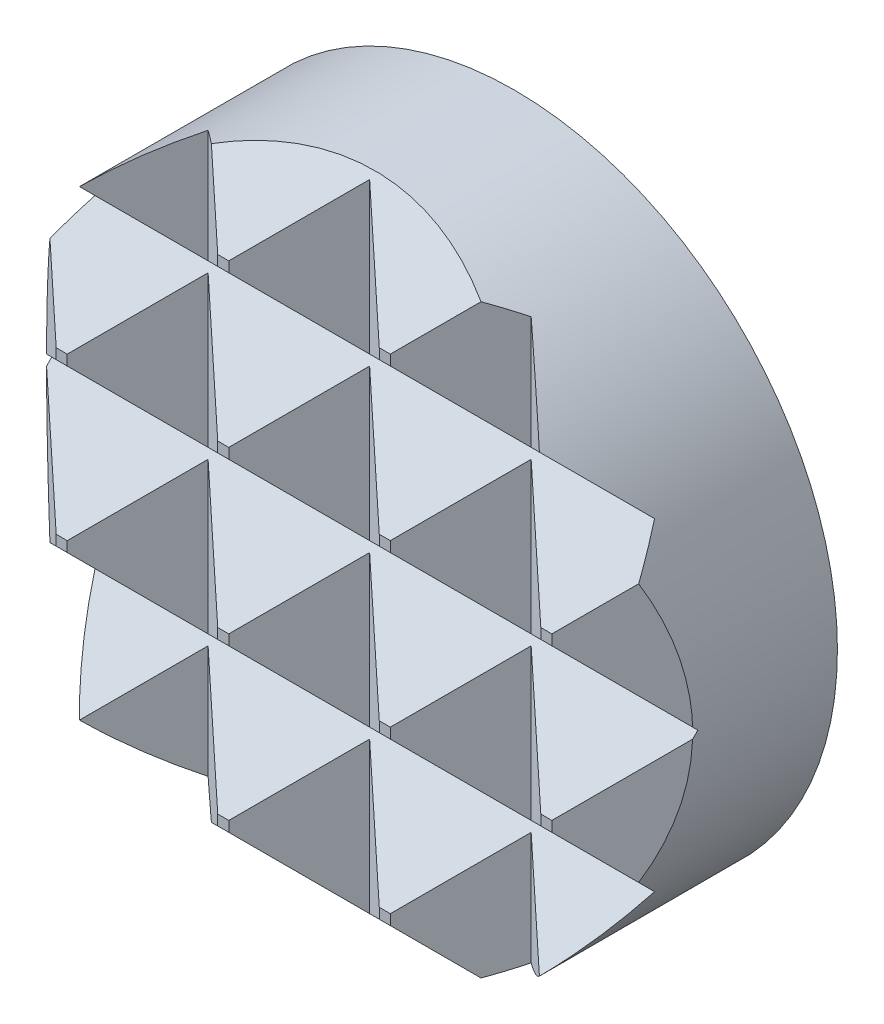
ISO-10303-21;
HEADER;
FILE_DESCRIPTION(('STEP AP214'),'2;1');
FILE_NAME('part.step','',(''),(''),'','','');
FILE_SCHEMA(('AUTOMOTIVE_DESIGN { 1 0 10303 214 1 1 1 1 }'));
ENDSEC;
DATA;
#1=APPLICATION_CONTEXT('core data for automotive mechanical design processes');
#2=APPLICATION_PROTOCOL_DEFINITION('international standard','automotive_design',2000,#1);
#3=PRODUCT_CONTEXT('',#1,'mechanical');
#4=PRODUCT('Part','Part','',(#3));
#5=PRODUCT_RELATED_PRODUCT_CATEGORY('part','',(#4));
#6=PRODUCT_DEFINITION_FORMATION('','',#4);
#7=PRODUCT_DEFINITION_CONTEXT('part definition',#1,'design');
#8=PRODUCT_DEFINITION('design','',#6,#7);
#9=PRODUCT_DEFINITION_SHAPE('','',#8);
#10=(LENGTH_UNIT() NAMED_UNIT(*) SI_UNIT(.MILLI.,.METRE.));
#11=(NAMED_UNIT(*) PLANE_ANGLE_UNIT() SI_UNIT($,.RADIAN.));
#12=(NAMED_UNIT(*) SI_UNIT($,.STERADIAN.) SOLID_ANGLE_UNIT());
#13=UNCERTAINTY_MEASURE_WITH_UNIT(LENGTH_MEASURE(1.E-05),#10,'distance_accuracy_value','');
#14=(GEOMETRIC_REPRESENTATION_CONTEXT(3) GLOBAL_UNCERTAINTY_ASSIGNED_CONTEXT((#13)) GLOBAL_UNIT_ASSIGNED_CONTEXT((#10,
#11,#12)) REPRESENTATION_CONTEXT('',''));
#15=CARTESIAN_POINT('',(0.,0.,0.));
#16=DIRECTION('',(0.,0.,1.));
#17=DIRECTION('',(1.,0.,0.));
#18=AXIS2_PLACEMENT_3D('',#15,#16,#17);
#19=CARTESIAN_POINT('',(4.763525,1.266825,3.679825));
#20=DIRECTION('',(0.,0.,-1.));
#21=DIRECTION('',(-1.,0.,0.));
#22=AXIS2_PLACEMENT_3D('',#19,#20,#21);
#23=PLANE('',#22);
#24=DIRECTION('',(-1.,0.,0.));
#25=VECTOR('',#24,1.);
#26=CARTESIAN_POINT('',(4.763525,1.114425,3.679825));
#27=LINE('',#26,#25);
#28=CARTESIAN_POINT('',(3.724275,1.114425,3.679825));
#29=VERTEX_POINT('',#28);
#30=CARTESIAN_POINT('',(3.56145448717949,1.114425,3.679825));
#31=VERTEX_POINT('',#30);
#32=EDGE_CURVE('E354',#29,#31,#27,.T.);
#33=ORIENTED_EDGE('',*,*,#32,.F.);
#34=DIRECTION('',(0.,1.,0.));
#35=VECTOR('',#34,1.);
#36=CARTESIAN_POINT('',(3.724275,1.266825,3.679825));
#37=LINE('',#36,#35);
#38=CARTESIAN_POINT('',(3.724275,1.266825,3.679825));
#39=VERTEX_POINT('',#38);
#40=EDGE_CURVE('E29',#29,#39,#37,.T.);
#41=ORIENTED_EDGE('',*,*,#40,.T.);
#42=DIRECTION('',(-1.,0.,0.));
#43=VECTOR('',#42,1.);
#44=CARTESIAN_POINT('',(4.763525,1.266825,3.679825));
#45=LINE('',#44,#43);
#46=CARTESIAN_POINT('',(3.56145448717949,1.266825,3.679825));
#47=VERTEX_POINT('',#46);
#48=EDGE_CURVE('E349',#39,#47,#45,.T.);
#49=ORIENTED_EDGE('',*,*,#48,.T.);
#50=DIRECTION('',(0.,-1.,0.));
#51=VECTOR('',#50,1.);
#52=CARTESIAN_POINT('',(3.56145448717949,1.266825,3.679825));
#53=LINE('',#52,#51);
#54=EDGE_CURVE('E480',#47,#31,#53,.T.);
#55=ORIENTED_EDGE('',*,*,#54,.T.);
#56=EDGE_LOOP('',(#33,#41,#49,#55));
#57=FACE_BOUND('',#56,.T.);
#58=ADVANCED_FACE('F14',(#57),#23,.F.);
#59=CARTESIAN_POINT('',(4.763525,-1.114425,3.679825));
#60=DIRECTION('',(0.,0.,-1.));
#61=DIRECTION('',(-1.,0.,0.));
#62=AXIS2_PLACEMENT_3D('',#59,#60,#61);
#63=PLANE('',#62);
#64=DIRECTION('',(-1.,0.,0.));
#65=VECTOR('',#64,1.);
#66=CARTESIAN_POINT('',(4.763525,-1.266825,3.679825));
#67=LINE('',#66,#65);
#68=CARTESIAN_POINT('',(3.724275,-1.266825,3.679825));
#69=VERTEX_POINT('',#68);
#70=CARTESIAN_POINT('',(3.56145448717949,-1.266825,3.679825));
#71=VERTEX_POINT('',#70);
#72=EDGE_CURVE('E343',#69,#71,#67,.T.);
#73=ORIENTED_EDGE('',*,*,#72,.F.);
#74=DIRECTION('',(0.,1.,0.));
#75=VECTOR('',#74,1.);
#76=CARTESIAN_POINT('',(3.724275,-1.114425,3.679825));
#77=LINE('',#76,#75);
#78=CARTESIAN_POINT('',(3.724275,-1.114425,3.679825));
#79=VERTEX_POINT('',#78);
#80=EDGE_CURVE('E37',#69,#79,#77,.T.);
#81=ORIENTED_EDGE('',*,*,#80,.T.);
#82=DIRECTION('',(-1.,0.,0.));
#83=VECTOR('',#82,1.);
#84=CARTESIAN_POINT('',(4.763525,-1.114425,3.679825));
#85=LINE('',#84,#83);
#86=CARTESIAN_POINT('',(3.56145448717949,-1.114425,3.679825));
#87=VERTEX_POINT('',#86);
#88=EDGE_CURVE('E337',#79,#87,#85,.T.);
#89=ORIENTED_EDGE('',*,*,#88,.T.);
#90=DIRECTION('',(0.,-1.,0.));
#91=VECTOR('',#90,1.);
#92=CARTESIAN_POINT('',(3.56145448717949,-1.114425,3.679825));
#93=LINE('',#92,#91);
#94=EDGE_CURVE('E471',#87,#71,#93,.T.);
#95=ORIENTED_EDGE('',*,*,#94,.T.);
#96=EDGE_LOOP('',(#73,#81,#89,#95));
#97=FACE_BOUND('',#96,.T.);
#98=ADVANCED_FACE('F683',(#97),#63,.F.);
#99=CARTESIAN_POINT('',(1.343025,1.114425,3.679825));
#100=VERTEX_POINT('',#99);
#101=CARTESIAN_POINT('',(1.18020448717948,1.114425,3.679825));
#102=VERTEX_POINT('',#101);
#103=EDGE_CURVE('E356',#100,#102,#27,.T.);
#104=ORIENTED_EDGE('',*,*,#103,.F.);
#105=DIRECTION('',(0.,1.,0.));
#106=VECTOR('',#105,1.);
#107=CARTESIAN_POINT('',(1.343025,1.266825,3.679825));
#108=LINE('',#107,#106);
#109=CARTESIAN_POINT('',(1.343025,1.266825,3.679825));
#110=VERTEX_POINT('',#109);
#111=EDGE_CURVE('E450',#100,#110,#108,.T.);
#112=ORIENTED_EDGE('',*,*,#111,.T.);
#113=CARTESIAN_POINT('',(1.18020448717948,1.266825,3.679825));
#114=VERTEX_POINT('',#113);
#115=EDGE_CURVE('E352',#110,#114,#45,.T.);
#116=ORIENTED_EDGE('',*,*,#115,.T.);
#117=DIRECTION('',(0.,-1.,0.));
#118=VECTOR('',#117,1.);
#119=CARTESIAN_POINT('',(1.18020448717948,1.266825,3.679825));
#120=LINE('',#119,#118);
#121=EDGE_CURVE('E544',#114,#102,#120,.T.);
#122=ORIENTED_EDGE('',*,*,#121,.T.);
#123=EDGE_LOOP('',(#104,#112,#116,#122));
#124=FACE_BOUND('',#123,.T.);
#125=ADVANCED_FACE('F738',(#124),#23,.F.);
#126=CARTESIAN_POINT('',(1.343025,-1.266825,3.679825));
#127=VERTEX_POINT('',#126);
#128=CARTESIAN_POINT('',(1.18020448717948,-1.266825,3.679825));
#129=VERTEX_POINT('',#128);
#130=EDGE_CURVE('E658',#127,#129,#67,.T.);
#131=ORIENTED_EDGE('',*,*,#130,.F.);
#132=DIRECTION('',(0.,1.,0.));
#133=VECTOR('',#132,1.);
#134=CARTESIAN_POINT('',(1.343025,-1.114425,3.679825));
#135=LINE('',#134,#133);
#136=CARTESIAN_POINT('',(1.343025,-1.114425,3.679825));
#137=VERTEX_POINT('',#136);
#138=EDGE_CURVE('E441',#127,#137,#135,.T.);
#139=ORIENTED_EDGE('',*,*,#138,.T.);
#140=CARTESIAN_POINT('',(1.18020448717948,-1.114425,3.679825));
#141=VERTEX_POINT('',#140);
#142=EDGE_CURVE('E676',#137,#141,#85,.T.);
#143=ORIENTED_EDGE('',*,*,#142,.T.);
#144=DIRECTION('',(0.,-1.,0.));
#145=VECTOR('',#144,1.);
#146=CARTESIAN_POINT('',(1.18020448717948,-1.114425,3.679825));
#147=LINE('',#146,#145);
#148=EDGE_CURVE('E535',#141,#129,#147,.T.);
#149=ORIENTED_EDGE('',*,*,#148,.T.);
#150=EDGE_LOOP('',(#131,#139,#143,#149));
#151=FACE_BOUND('',#150,.T.);
#152=ADVANCED_FACE('F695',(#151),#63,.F.);
#153=CARTESIAN_POINT('',(4.7635,3.648075,3.679825));
#154=DIRECTION('',(0.,0.,-1.));
#155=DIRECTION('',(-1.,0.,0.));
#156=AXIS2_PLACEMENT_3D('',#153,#154,#155);
#157=PLANE('',#156);
#158=DIRECTION('',(-1.,0.,0.));
#159=VECTOR('',#158,1.);
#160=CARTESIAN_POINT('',(4.7635,3.495675,3.679825));
#161=LINE('',#160,#159);
#162=CARTESIAN_POINT('',(1.343025,3.495675,3.679825));
#163=VERTEX_POINT('',#162);
#164=CARTESIAN_POINT('',(1.18020448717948,3.495675,3.679825));
#165=VERTEX_POINT('',#164);
#166=EDGE_CURVE('E364',#163,#165,#161,.T.);
#167=ORIENTED_EDGE('',*,*,#166,.F.);
#168=DIRECTION('',(0.,1.,0.));
#169=VECTOR('',#168,1.);
#170=CARTESIAN_POINT('',(1.343025,3.648075,3.679825));
#171=LINE('',#170,#169);
#172=CARTESIAN_POINT('',(1.343025,3.648075,3.679825));
#173=VERTEX_POINT('',#172);
#174=EDGE_CURVE('E459',#163,#173,#171,.T.);
#175=ORIENTED_EDGE('',*,*,#174,.T.);
#176=DIRECTION('',(-1.,0.,0.));
#177=VECTOR('',#176,1.);
#178=CARTESIAN_POINT('',(4.7635,3.648075,3.679825));
#179=LINE('',#178,#177);
#180=CARTESIAN_POINT('',(1.18020448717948,3.648075,3.679825));
#181=VERTEX_POINT('',#180);
#182=EDGE_CURVE('E360',#173,#181,#179,.T.);
#183=ORIENTED_EDGE('',*,*,#182,.T.);
#184=DIRECTION('',(0.,-1.,0.));
#185=VECTOR('',#184,1.);
#186=CARTESIAN_POINT('',(1.18020448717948,3.648075,3.679825));
#187=LINE('',#186,#185);
#188=EDGE_CURVE('E553',#181,#165,#187,.T.);
#189=ORIENTED_EDGE('',*,*,#188,.T.);
#190=EDGE_LOOP('',(#167,#175,#183,#189));
#191=FACE_BOUND('',#190,.T.);
#192=ADVANCED_FACE('F812',(#191),#157,.F.);
#193=CARTESIAN_POINT('',(4.763525,-3.495675,3.679825));
#194=DIRECTION('',(0.,0.,-1.));
#195=DIRECTION('',(-1.,0.,0.));
#196=AXIS2_PLACEMENT_3D('',#193,#194,#195);
#197=PLANE('',#196);
#198=DIRECTION('',(-1.,0.,0.));
#199=VECTOR('',#198,1.);
#200=CARTESIAN_POINT('',(4.763525,-3.648075,3.679825));
#201=LINE('',#200,#199);
#202=CARTESIAN_POINT('',(1.343025,-3.648075,3.679825));
#203=VERTEX_POINT('',#202);
#204=CARTESIAN_POINT('',(1.18020448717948,-3.648075,3.679825));
#205=VERTEX_POINT('',#204);
#206=EDGE_CURVE('E643',#203,#205,#201,.T.);
#207=ORIENTED_EDGE('',*,*,#206,.F.);
#208=DIRECTION('',(0.,1.,0.));
#209=VECTOR('',#208,1.);
#210=CARTESIAN_POINT('',(1.343025,-3.495675,3.679825));
#211=LINE('',#210,#209);
#212=CARTESIAN_POINT('',(1.343025,-3.495675,3.679825));
#213=VERTEX_POINT('',#212);
#214=EDGE_CURVE('E431',#203,#213,#211,.T.);
#215=ORIENTED_EDGE('',*,*,#214,.T.);
#216=DIRECTION('',(-1.,0.,0.));
#217=VECTOR('',#216,1.);
#218=CARTESIAN_POINT('',(4.763525,-3.495675,3.679825));
#219=LINE('',#218,#217);
#220=CARTESIAN_POINT('',(1.18020448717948,-3.495675,3.679825));
#221=VERTEX_POINT('',#220);
#222=EDGE_CURVE('E647',#213,#221,#219,.T.);
#223=ORIENTED_EDGE('',*,*,#222,.T.);
#224=DIRECTION('',(0.,-1.,0.));
#225=VECTOR('',#224,1.);
#226=CARTESIAN_POINT('',(1.18020448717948,-3.495675,3.679825));
#227=LINE('',#226,#225);
#228=EDGE_CURVE('E526',#221,#205,#227,.T.);
#229=ORIENTED_EDGE('',*,*,#228,.T.);
#230=EDGE_LOOP('',(#207,#215,#223,#229));
#231=FACE_BOUND('',#230,.T.);
#232=ADVANCED_FACE('F758',(#231),#197,.F.);
#233=CARTESIAN_POINT('',(-1.038225,1.114425,3.679825));
#234=VERTEX_POINT('',#233);
#235=CARTESIAN_POINT('',(-1.20104551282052,1.114425,3.679825));
#236=VERTEX_POINT('',#235);
#237=EDGE_CURVE('E731',#234,#236,#27,.T.);
#238=ORIENTED_EDGE('',*,*,#237,.F.);
#239=DIRECTION('',(0.,1.,0.));
#240=VECTOR('',#239,1.);
#241=CARTESIAN_POINT('',(-1.038225,1.266825,3.679825));
#242=LINE('',#241,#240);
#243=CARTESIAN_POINT('',(-1.038225,1.266825,3.679825));
#244=VERTEX_POINT('',#243);
#245=EDGE_CURVE('E511',#234,#244,#242,.T.);
#246=ORIENTED_EDGE('',*,*,#245,.T.);
#247=CARTESIAN_POINT('',(-1.20104551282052,1.266825,3.679825));
#248=VERTEX_POINT('',#247);
#249=EDGE_CURVE('E713',#244,#248,#45,.T.);
#250=ORIENTED_EDGE('',*,*,#249,.T.);
#251=DIRECTION('',(0.,-1.,0.));
#252=VECTOR('',#251,1.);
#253=CARTESIAN_POINT('',(-1.20104551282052,1.266825,3.679825));
#254=LINE('',#253,#252);
#255=EDGE_CURVE('E585',#248,#236,#254,.T.);
#256=ORIENTED_EDGE('',*,*,#255,.T.);
#257=EDGE_LOOP('',(#238,#246,#250,#256));
#258=FACE_BOUND('',#257,.T.);
#259=ADVANCED_FACE('F798',(#258),#23,.F.);
#260=CARTESIAN_POINT('',(-1.038225,-1.266825,3.679825));
#261=VERTEX_POINT('',#260);
#262=CARTESIAN_POINT('',(-1.20104551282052,-1.266825,3.679825));
#263=VERTEX_POINT('',#262);
#264=EDGE_CURVE('E660',#261,#263,#67,.T.);
#265=ORIENTED_EDGE('',*,*,#264,.F.);
#266=DIRECTION('',(0.,1.,0.));
#267=VECTOR('',#266,1.);
#268=CARTESIAN_POINT('',(-1.038225,-1.114425,3.679825));
#269=LINE('',#268,#267);
#270=CARTESIAN_POINT('',(-1.038225,-1.114425,3.679825));
#271=VERTEX_POINT('',#270);
#272=EDGE_CURVE('E502',#261,#271,#269,.T.);
#273=ORIENTED_EDGE('',*,*,#272,.T.);
#274=CARTESIAN_POINT('',(-1.20104551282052,-1.114425,3.679825));
#275=VERTEX_POINT('',#274);
#276=EDGE_CURVE('E674',#271,#275,#85,.T.);
#277=ORIENTED_EDGE('',*,*,#276,.T.);
#278=DIRECTION('',(0.,-1.,0.));
#279=VECTOR('',#278,1.);
#280=CARTESIAN_POINT('',(-1.20104551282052,-1.114425,3.679825));
#281=LINE('',#280,#279);
#282=EDGE_CURVE('E576',#275,#263,#281,.T.);
#283=ORIENTED_EDGE('',*,*,#282,.T.);
#284=EDGE_LOOP('',(#265,#273,#277,#283));
#285=FACE_BOUND('',#284,.T.);
#286=ADVANCED_FACE('F672',(#285),#63,.F.);
#287=CARTESIAN_POINT('',(0.,0.,0.));
#288=DIRECTION('',(0.,0.,1.));
#289=DIRECTION('',(1.,0.,0.));
#290=AXIS2_PLACEMENT_3D('',#287,#288,#289);
#291=CYLINDRICAL_SURFACE('',#290,4.7625);
#292=CARTESIAN_POINT('',(0.,0.,7.4041));
#293=DIRECTION('',(-0.707106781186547,0.,-0.707106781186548));
#294=DIRECTION('',(-0.707106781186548,0.,0.707106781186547));
#295=AXIS2_PLACEMENT_3D('',#292,#293,#294);
#296=ELLIPSE('',#295,6.73519209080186,4.7625);
#297=CARTESIAN_POINT('',(4.36415766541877,-1.90670766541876,3.03994233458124));
#298=VERTEX_POINT('',#297);
#299=CARTESIAN_POINT('',(4.76188040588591,-0.076819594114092,2.64221959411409));
#300=VERTEX_POINT('',#299);
#301=EDGE_CURVE('E311',#298,#300,#296,.F.);
#302=ORIENTED_EDGE('',*,*,#301,.F.);
#303=CARTESIAN_POINT('',(0.,0.,4.94665));
#304=DIRECTION('',(0.,0.707106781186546,-0.70710678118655));
#305=DIRECTION('',(0.,0.70710678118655,0.707106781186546));
#306=AXIS2_PLACEMENT_3D('',#303,#304,#305);
#307=ELLIPSE('',#306,6.73519209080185,4.7625);
#308=CARTESIAN_POINT('',(4.12444598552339,-2.38125,2.5654));
#309=VERTEX_POINT('',#308);
#310=EDGE_CURVE('E320',#298,#309,#307,.T.);
#311=ORIENTED_EDGE('',*,*,#310,.T.);
#312=CARTESIAN_POINT('',(0.,0.,0.18415));
#313=DIRECTION('',(0.,-0.707106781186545,-0.70710678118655));
#314=DIRECTION('',(0.,-0.70710678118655,0.707106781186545));
#315=AXIS2_PLACEMENT_3D('',#312,#313,#314);
#316=ELLIPSE('',#315,6.73519209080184,4.7625);
#317=CARTESIAN_POINT('',(3.39010322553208,-3.34493742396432,3.52908742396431));
#318=VERTEX_POINT('',#317);
#319=EDGE_CURVE('E650',#309,#318,#316,.T.);
#320=ORIENTED_EDGE('',*,*,#319,.T.);
#321=CARTESIAN_POINT('',(0.,0.,0.54681616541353));
#322=DIRECTION('',(0.660500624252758,0.,-0.750825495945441));
#323=DIRECTION('',(0.750825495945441,0.,0.660500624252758));
#324=AXIS2_PLACEMENT_3D('',#321,#322,#323);
#325=ELLIPSE('',#324,6.34301848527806,4.7625);
#326=CARTESIAN_POINT('',(2.38125,-4.12444598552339,2.6416));
#327=VERTEX_POINT('',#326);
#328=EDGE_CURVE('E465',#327,#318,#325,.F.);
#329=ORIENTED_EDGE('',*,*,#328,.F.);
#330=CARTESIAN_POINT('',(0.,0.,5.02285));
#331=DIRECTION('',(-0.707106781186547,0.,-0.707106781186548));
#332=DIRECTION('',(-0.707106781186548,0.,0.707106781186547));
#333=AXIS2_PLACEMENT_3D('',#330,#331,#332);
#334=ELLIPSE('',#333,6.73519209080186,4.7625);
#335=CARTESIAN_POINT('',(2.01171096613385,-4.31676096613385,3.01113903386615));
#336=VERTEX_POINT('',#335);
#337=EDGE_CURVE('E429',#336,#327,#334,.F.);
#338=ORIENTED_EDGE('',*,*,#337,.F.);
#339=CARTESIAN_POINT('',(0.,0.,7.3279));
#340=DIRECTION('',(0.,-0.707106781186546,0.70710678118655));
#341=DIRECTION('',(0.,0.70710678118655,0.707106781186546));
#342=AXIS2_PLACEMENT_3D('',#339,#340,#341);
#343=ELLIPSE('',#342,6.73519209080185,4.7625);
#344=CARTESIAN_POINT('',(-1.9785613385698,-4.33205508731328,2.99584491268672));
#345=VERTEX_POINT('',#344);
#346=EDGE_CURVE('E645',#345,#336,#343,.T.);
#347=ORIENTED_EDGE('',*,*,#346,.F.);
#348=CARTESIAN_POINT('',(0.,0.,4.73638383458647));
#349=DIRECTION('',(0.660500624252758,0.,-0.750825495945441));
#350=DIRECTION('',(0.750825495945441,0.,0.660500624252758));
#351=AXIS2_PLACEMENT_3D('',#348,#349,#350);
#352=ELLIPSE('',#351,6.34301848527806,4.7625);
#353=CARTESIAN_POINT('',(-2.38125,-4.12444598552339,2.6416));
#354=VERTEX_POINT('',#353);
#355=EDGE_CURVE('E567',#354,#345,#352,.F.);
#356=ORIENTED_EDGE('',*,*,#355,.F.);
#357=CARTESIAN_POINT('',(0.,0.,0.26035));
#358=DIRECTION('',(-0.707106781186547,0.,-0.707106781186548));
#359=DIRECTION('',(-0.707106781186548,0.,0.707106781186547));
#360=AXIS2_PLACEMENT_3D('',#357,#358,#359);
#361=ELLIPSE('',#360,6.73519209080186,4.7625);
#362=CARTESIAN_POINT('',(-3.32928051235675,-3.40548051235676,3.58963051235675));
#363=VERTEX_POINT('',#362);
#364=EDGE_CURVE('E600',#363,#354,#361,.F.);
#365=ORIENTED_EDGE('',*,*,#364,.F.);
#366=CARTESIAN_POINT('',(0.,0.,0.18415));
#367=DIRECTION('',(0.,0.707106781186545,0.70710678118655));
#368=DIRECTION('',(0.,-0.70710678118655,0.707106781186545));
#369=AXIS2_PLACEMENT_3D('',#366,#367,#368);
#370=ELLIPSE('',#369,6.73519209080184,4.7625);
#371=CARTESIAN_POINT('',(-4.12444598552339,-2.38125,2.5654));
#372=VERTEX_POINT('',#371);
#373=EDGE_CURVE('E649',#372,#363,#370,.T.);
#374=ORIENTED_EDGE('',*,*,#373,.F.);
#375=CARTESIAN_POINT('',(0.,0.,4.94665));
#376=DIRECTION('',(0.,-0.707106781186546,0.70710678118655));
#377=DIRECTION('',(0.,0.70710678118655,0.707106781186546));
#378=AXIS2_PLACEMENT_3D('',#375,#376,#377);
#379=ELLIPSE('',#378,6.73519209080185,4.7625);
#380=CARTESIAN_POINT('',(-4.34891591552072,-1.94122039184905,3.00542960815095));
#381=VERTEX_POINT('',#380);
#382=EDGE_CURVE('E334',#381,#372,#379,.T.);
#383=ORIENTED_EDGE('',*,*,#382,.F.);
#384=CARTESIAN_POINT('',(0.,0.,6.83116766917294));
#385=DIRECTION('',(0.660500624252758,0.,-0.750825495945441));
#386=DIRECTION('',(0.750825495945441,0.,0.660500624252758));
#387=AXIS2_PLACEMENT_3D('',#384,#385,#386);
#388=ELLIPSE('',#387,6.34301848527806,4.7625);
#389=CARTESIAN_POINT('',(-4.761881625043,-0.0767439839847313,2.64214398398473));
#390=VERTEX_POINT('',#389);
#391=EDGE_CURVE('E627',#390,#381,#388,.F.);
#392=ORIENTED_EDGE('',*,*,#391,.F.);
#393=CARTESIAN_POINT('',(0.,0.,2.5654));
#394=DIRECTION('',(0.,0.707106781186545,0.70710678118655));
#395=DIRECTION('',(0.,-0.70710678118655,0.707106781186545));
#396=AXIS2_PLACEMENT_3D('',#393,#394,#395);
#397=ELLIPSE('',#396,6.73519209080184,4.7625);
#398=CARTESIAN_POINT('',(-4.7625,0.,2.5654));
#399=VERTEX_POINT('',#398);
#400=EDGE_CURVE('E340',#399,#390,#397,.T.);
#401=ORIENTED_EDGE('',*,*,#400,.F.);
#402=CARTESIAN_POINT('',(0.,0.,2.5654));
#403=DIRECTION('',(0.,-0.707106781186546,0.70710678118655));
#404=DIRECTION('',(0.,0.70710678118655,0.707106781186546));
#405=AXIS2_PLACEMENT_3D('',#402,#403,#404);
#406=ELLIPSE('',#405,6.73519209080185,4.7625);
#407=CARTESIAN_POINT('',(-4.761881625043,0.076743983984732,2.64214398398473));
#408=VERTEX_POINT('',#407);
#409=EDGE_CURVE('E330',#408,#399,#406,.T.);
#410=ORIENTED_EDGE('',*,*,#409,.F.);
#411=CARTESIAN_POINT('',(-4.34891591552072,1.94122039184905,3.00542960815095));
#412=VERTEX_POINT('',#411);
#413=EDGE_CURVE('E630',#412,#408,#388,.F.);
#414=ORIENTED_EDGE('',*,*,#413,.F.);
#415=CARTESIAN_POINT('',(0.,0.,4.94665));
#416=DIRECTION('',(0.,0.707106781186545,0.70710678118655));
#417=DIRECTION('',(0.,-0.70710678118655,0.707106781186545));
#418=AXIS2_PLACEMENT_3D('',#415,#416,#417);
#419=ELLIPSE('',#418,6.73519209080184,4.7625);
#420=CARTESIAN_POINT('',(-4.12444598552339,2.38125,2.5654));
#421=VERTEX_POINT('',#420);
#422=EDGE_CURVE('E332',#421,#412,#419,.T.);
#423=ORIENTED_EDGE('',*,*,#422,.F.);
#424=CARTESIAN_POINT('',(0.,0.,0.18415));
#425=DIRECTION('',(0.,-0.707106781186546,0.70710678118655));
#426=DIRECTION('',(0.,0.70710678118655,0.707106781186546));
#427=AXIS2_PLACEMENT_3D('',#424,#425,#426);
#428=ELLIPSE('',#427,6.73519209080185,4.7625);
#429=CARTESIAN_POINT('',(-3.32928051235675,3.40548051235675,3.58963051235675));
#430=VERTEX_POINT('',#429);
#431=EDGE_CURVE('E347',#430,#421,#428,.T.);
#432=ORIENTED_EDGE('',*,*,#431,.F.);
#433=CARTESIAN_POINT('',(-2.38125,4.12444598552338,2.6416));
#434=VERTEX_POINT('',#433);
#435=EDGE_CURVE('E603',#434,#430,#361,.F.);
#436=ORIENTED_EDGE('',*,*,#435,.F.);
#437=CARTESIAN_POINT('',(-1.9785613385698,4.33205508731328,2.99584491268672));
#438=VERTEX_POINT('',#437);
#439=EDGE_CURVE('E570',#438,#434,#352,.F.);
#440=ORIENTED_EDGE('',*,*,#439,.F.);
#441=CARTESIAN_POINT('',(0.,0.,7.3279));
#442=DIRECTION('',(0.,0.707106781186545,0.70710678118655));
#443=DIRECTION('',(0.,-0.70710678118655,0.707106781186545));
#444=AXIS2_PLACEMENT_3D('',#441,#442,#443);
#445=ELLIPSE('',#444,6.73519209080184,4.7625);
#446=CARTESIAN_POINT('',(2.01171096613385,4.31676096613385,3.01113903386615));
#447=VERTEX_POINT('',#446);
#448=EDGE_CURVE('E381',#447,#438,#445,.T.);
#449=ORIENTED_EDGE('',*,*,#448,.F.);
#450=CARTESIAN_POINT('',(2.38125,4.12444598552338,2.6416));
#451=VERTEX_POINT('',#450);
#452=EDGE_CURVE('E432',#451,#447,#334,.F.);
#453=ORIENTED_EDGE('',*,*,#452,.F.);
#454=CARTESIAN_POINT('',(3.39010322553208,3.34493742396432,3.52908742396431));
#455=VERTEX_POINT('',#454);
#456=EDGE_CURVE('E468',#455,#451,#325,.F.);
#457=ORIENTED_EDGE('',*,*,#456,.F.);
#458=CARTESIAN_POINT('',(0.,0.,0.18415));
#459=DIRECTION('',(0.,0.707106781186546,-0.70710678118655));
#460=DIRECTION('',(0.,0.70710678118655,0.707106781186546));
#461=AXIS2_PLACEMENT_3D('',#458,#459,#460);
#462=ELLIPSE('',#461,6.73519209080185,4.7625);
#463=CARTESIAN_POINT('',(4.12444598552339,2.38125,2.5654));
#464=VERTEX_POINT('',#463);
#465=EDGE_CURVE('E369',#455,#464,#462,.T.);
#466=ORIENTED_EDGE('',*,*,#465,.T.);
#467=CARTESIAN_POINT('',(0.,0.,4.94665));
#468=DIRECTION('',(0.,-0.707106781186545,-0.70710678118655));
#469=DIRECTION('',(0.,-0.70710678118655,0.707106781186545));
#470=AXIS2_PLACEMENT_3D('',#467,#468,#469);
#471=ELLIPSE('',#470,6.73519209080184,4.7625);
#472=CARTESIAN_POINT('',(4.36415766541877,1.90670766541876,3.03994233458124));
#473=VERTEX_POINT('',#472);
#474=EDGE_CURVE('E348',#464,#473,#471,.T.);
#475=ORIENTED_EDGE('',*,*,#474,.T.);
#476=CARTESIAN_POINT('',(4.76188040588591,0.0768195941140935,2.6422195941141));
#477=VERTEX_POINT('',#476);
#478=EDGE_CURVE('E325',#477,#473,#296,.F.);
#479=ORIENTED_EDGE('',*,*,#478,.F.);
#480=CARTESIAN_POINT('',(0.,0.,2.5654));
#481=DIRECTION('',(0.,0.707106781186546,-0.70710678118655));
#482=DIRECTION('',(0.,0.70710678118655,0.707106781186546));
#483=AXIS2_PLACEMENT_3D('',#480,#481,#482);
#484=ELLIPSE('',#483,6.73519209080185,4.7625);
#485=CARTESIAN_POINT('',(4.7625,0.,2.5654));
#486=VERTEX_POINT('',#485);
#487=EDGE_CURVE('E345',#477,#486,#484,.T.);
#488=ORIENTED_EDGE('',*,*,#487,.T.);
#489=CARTESIAN_POINT('',(0.,0.,2.5654));
#490=DIRECTION('',(0.,-0.707106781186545,-0.70710678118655));
#491=DIRECTION('',(0.,-0.70710678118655,0.707106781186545));
#492=AXIS2_PLACEMENT_3D('',#489,#490,#491);
#493=ELLIPSE('',#492,6.73519209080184,4.7625);
#494=EDGE_CURVE('E323',#486,#300,#493,.T.);
#495=ORIENTED_EDGE('',*,*,#494,.T.);
#496=EDGE_LOOP('',(#302,#311,#320,#329,#338,#347,#356,#365,#374,#383,#392,#401,#410,#414,#423,
#432,#436,#440,#449,#453,#457,#466,#475,#479,#488,#495));
#497=FACE_BOUND('',#496,.T.);
#498=CARTESIAN_POINT('',(0.,0.,0.508));
#499=DIRECTION('',(0.,0.,-1.));
#500=DIRECTION('',(-1.,0.,0.));
#501=AXIS2_PLACEMENT_3D('',#498,#499,#500);
#502=CIRCLE('',#501,4.7625);
#503=CARTESIAN_POINT('',(-4.7625,0.,0.508));
#504=VERTEX_POINT('',#503);
#505=EDGE_CURVE('E373',#504,#504,#502,.T.);
#506=ORIENTED_EDGE('',*,*,#505,.F.);
#507=EDGE_LOOP('',(#506));
#508=FACE_BOUND('',#507,.T.);
#509=ADVANCED_FACE('F16',(#497,#508),#291,.T.);
#510=CARTESIAN_POINT('',(0.,0.,0.508));
#511=DIRECTION('',(0.,0.,-1.));
#512=DIRECTION('',(-1.,0.,0.));
#513=AXIS2_PLACEMENT_3D('',#510,#511,#512);
#514=PLANE('',#513);
#515=CARTESIAN_POINT('',(0.,0.,0.508));
#516=DIRECTION('',(0.,0.,-1.));
#517=DIRECTION('',(-1.,0.,0.));
#518=AXIS2_PLACEMENT_3D('',#515,#516,#517);
#519=CIRCLE('',#518,4.5085);
#520=CARTESIAN_POINT('',(-4.5085,0.,0.508));
#521=VERTEX_POINT('',#520);
#522=EDGE_CURVE('E370',#521,#521,#519,.T.);
#523=ORIENTED_EDGE('',*,*,#522,.F.);
#524=EDGE_LOOP('',(#523));
#525=FACE_BOUND('',#524,.T.);
#526=ORIENTED_EDGE('',*,*,#505,.T.);
#527=EDGE_LOOP('',(#526));
#528=FACE_BOUND('',#527,.T.);
#529=ADVANCED_FACE('F1123',(#525,#528),#514,.T.);
#530=CARTESIAN_POINT('',(0.,0.,0.));
#531=DIRECTION('',(0.,0.,1.));
#532=DIRECTION('',(1.,0.,0.));
#533=AXIS2_PLACEMENT_3D('',#530,#531,#532);
#534=PLANE('',#533);
#535=CARTESIAN_POINT('',(0.,0.,0.));
#536=DIRECTION('',(0.,0.,1.));
#537=DIRECTION('',(1.,0.,0.));
#538=AXIS2_PLACEMENT_3D('',#535,#536,#537);
#539=CIRCLE('',#538,4.0005);
#540=CARTESIAN_POINT('',(4.0005,0.,0.));
#541=VERTEX_POINT('',#540);
#542=EDGE_CURVE('E376',#541,#541,#539,.F.);
#543=ORIENTED_EDGE('',*,*,#542,.T.);
#544=EDGE_LOOP('',(#543));
#545=FACE_BOUND('',#544,.T.);
#546=ADVANCED_FACE('F1113',(#545),#534,.F.);
#547=CARTESIAN_POINT('',(0.,0.,0.));
#548=DIRECTION('',(0.,0.,1.));
#549=DIRECTION('',(1.,0.,0.));
#550=AXIS2_PLACEMENT_3D('',#547,#548,#549);
#551=CONICAL_SURFACE('',#550,4.0005,0.785398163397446);
#552=ORIENTED_EDGE('',*,*,#522,.T.);
#553=EDGE_LOOP('',(#552));
#554=FACE_BOUND('',#553,.T.);
#555=ORIENTED_EDGE('',*,*,#542,.F.);
#556=EDGE_LOOP('',(#555));
#557=FACE_BOUND('',#556,.T.);
#558=ADVANCED_FACE('F1103',(#554,#557),#551,.T.);
#559=CARTESIAN_POINT('',(-1.038225,3.495675,3.679825));
#560=VERTEX_POINT('',#559);
#561=CARTESIAN_POINT('',(-1.20104551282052,3.495675,3.679825));
#562=VERTEX_POINT('',#561);
#563=EDGE_CURVE('E362',#560,#562,#161,.T.);
#564=ORIENTED_EDGE('',*,*,#563,.F.);
#565=DIRECTION('',(0.,1.,0.));
#566=VECTOR('',#565,1.);
#567=CARTESIAN_POINT('',(-1.038225,3.648075,3.679825));
#568=LINE('',#567,#566);
#569=CARTESIAN_POINT('',(-1.038225,3.648075,3.679825));
#570=VERTEX_POINT('',#569);
#571=EDGE_CURVE('E520',#560,#570,#568,.T.);
#572=ORIENTED_EDGE('',*,*,#571,.T.);
#573=CARTESIAN_POINT('',(-1.20104551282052,3.648075,3.679825));
#574=VERTEX_POINT('',#573);
#575=EDGE_CURVE('E363',#570,#574,#179,.T.);
#576=ORIENTED_EDGE('',*,*,#575,.T.);
#577=DIRECTION('',(0.,-1.,0.));
#578=VECTOR('',#577,1.);
#579=CARTESIAN_POINT('',(-1.20104551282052,3.648075,3.679825));
#580=LINE('',#579,#578);
#581=EDGE_CURVE('E594',#574,#562,#580,.T.);
#582=ORIENTED_EDGE('',*,*,#581,.T.);
#583=EDGE_LOOP('',(#564,#572,#576,#582));
#584=FACE_BOUND('',#583,.T.);
#585=ADVANCED_FACE('F1093',(#584),#157,.F.);
#586=CARTESIAN_POINT('',(4.7635,4.7625,2.5654));
#587=DIRECTION('',(0.,-0.707106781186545,-0.70710678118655));
#588=DIRECTION('',(0.,0.70710678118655,-0.707106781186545));
#589=AXIS2_PLACEMENT_3D('',#586,#587,#588);
#590=PLANE('',#589);
#591=ORIENTED_EDGE('',*,*,#182,.F.);
#592=DIRECTION('',(0.577350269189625,0.577350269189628,-0.577350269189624));
#593=VECTOR('',#592,1.);
#594=CARTESIAN_POINT('',(3.22613333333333,5.53118333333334,1.79671666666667));
#595=LINE('',#594,#593);
#596=EDGE_CURVE('E462',#173,#447,#595,.T.);
#597=ORIENTED_EDGE('',*,*,#596,.T.);
#598=ORIENTED_EDGE('',*,*,#448,.T.);
#599=DIRECTION('',(0.626501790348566,-0.55113315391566,0.551133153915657));
#600=VECTOR('',#599,1.);
#601=CARTESIAN_POINT('',(0.370474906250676,2.26560966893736,5.06229033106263));
#602=LINE('',#601,#600);
#603=EDGE_CURVE('E597',#438,#574,#602,.T.);
#604=ORIENTED_EDGE('',*,*,#603,.T.);
#605=ORIENTED_EDGE('',*,*,#575,.F.);
#606=DIRECTION('',(0.577350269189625,0.577350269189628,-0.577350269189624));
#607=VECTOR('',#606,1.);
#608=CARTESIAN_POINT('',(1.63863333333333,6.32493333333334,1.00296666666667));
#609=LINE('',#608,#607);
#610=CARTESIAN_POINT('',(0.,4.6863,2.6416));
#611=VERTEX_POINT('',#610);
#612=EDGE_CURVE('E523',#570,#611,#609,.T.);
#613=ORIENTED_EDGE('',*,*,#612,.T.);
#614=DIRECTION('',(0.626501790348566,-0.55113315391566,0.551133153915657));
#615=VECTOR('',#614,1.);
#616=CARTESIAN_POINT('',(1.81707358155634,3.08782173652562,4.24007826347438));
#617=LINE('',#616,#615);
#618=EDGE_CURVE('E556',#611,#181,#617,.T.);
#619=ORIENTED_EDGE('',*,*,#618,.T.);
#620=EDGE_LOOP('',(#591,#597,#598,#604,#605,#613,#619));
#621=FACE_BOUND('',#620,.T.);
#622=ADVANCED_FACE('F805',(#621),#590,.F.);
#623=CARTESIAN_POINT('',(4.7635,2.38125,2.5654));
#624=DIRECTION('',(0.,0.707106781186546,-0.70710678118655));
#625=DIRECTION('',(0.,0.70710678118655,0.707106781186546));
#626=AXIS2_PLACEMENT_3D('',#623,#624,#625);
#627=PLANE('',#626);
#628=ORIENTED_EDGE('',*,*,#465,.F.);
#629=DIRECTION('',(-0.626501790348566,-0.55113315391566,-0.551133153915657));
#630=VECTOR('',#629,1.);
#631=CARTESIAN_POINT('',(3.263672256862,3.23371619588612,3.41786619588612));
#632=LINE('',#631,#630);
#633=CARTESIAN_POINT('',(2.38125,2.45745,2.6416));
#634=VERTEX_POINT('',#633);
#635=EDGE_CURVE('E485',#455,#634,#632,.T.);
#636=ORIENTED_EDGE('',*,*,#635,.T.);
#637=DIRECTION('',(-0.577350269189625,0.577350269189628,0.577350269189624));
#638=VECTOR('',#637,1.);
#639=CARTESIAN_POINT('',(3.22613333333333,1.61256666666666,1.79671666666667));
#640=LINE('',#639,#638);
#641=EDGE_CURVE('E456',#634,#163,#640,.T.);
#642=ORIENTED_EDGE('',*,*,#641,.T.);
#643=ORIENTED_EDGE('',*,*,#166,.T.);
#644=DIRECTION('',(-0.626501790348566,-0.55113315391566,-0.551133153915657));
#645=VECTOR('',#644,1.);
#646=CARTESIAN_POINT('',(1.81707358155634,4.05592826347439,4.24007826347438));
#647=LINE('',#646,#645);
#648=CARTESIAN_POINT('',(0.,2.45745,2.6416));
#649=VERTEX_POINT('',#648);
#650=EDGE_CURVE('E550',#165,#649,#647,.T.);
#651=ORIENTED_EDGE('',*,*,#650,.T.);
#652=DIRECTION('',(-0.577350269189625,0.577350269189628,0.577350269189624));
#653=VECTOR('',#652,1.);
#654=CARTESIAN_POINT('',(1.63863333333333,0.818816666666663,1.00296666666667));
#655=LINE('',#654,#653);
#656=EDGE_CURVE('E517',#649,#560,#655,.T.);
#657=ORIENTED_EDGE('',*,*,#656,.T.);
#658=ORIENTED_EDGE('',*,*,#563,.T.);
#659=DIRECTION('',(-0.626501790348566,-0.55113315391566,-0.551133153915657));
#660=VECTOR('',#659,1.);
#661=CARTESIAN_POINT('',(0.370474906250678,4.87814033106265,5.06229033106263));
#662=LINE('',#661,#660);
#663=CARTESIAN_POINT('',(-2.38125,2.45745,2.6416));
#664=VERTEX_POINT('',#663);
#665=EDGE_CURVE('E591',#562,#664,#662,.T.);
#666=ORIENTED_EDGE('',*,*,#665,.T.);
#667=DIRECTION('',(-0.577350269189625,0.577350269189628,0.577350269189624));
#668=VECTOR('',#667,1.);
#669=CARTESIAN_POINT('',(0.0511333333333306,0.0250666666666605,0.209216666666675));
#670=LINE('',#669,#668);
#671=EDGE_CURVE('E621',#664,#430,#670,.T.);
#672=ORIENTED_EDGE('',*,*,#671,.T.);
#673=ORIENTED_EDGE('',*,*,#431,.T.);
#674=DIRECTION('',(-1.,0.,0.));
#675=VECTOR('',#674,1.);
#676=CARTESIAN_POINT('',(4.7635,2.38125,2.5654));
#677=LINE('',#676,#675);
#678=EDGE_CURVE('E366',#464,#421,#677,.T.);
#679=ORIENTED_EDGE('',*,*,#678,.F.);
#680=EDGE_LOOP('',(#628,#636,#642,#643,#651,#657,#658,#666,#672,#673,#679));
#681=FACE_BOUND('',#680,.T.);
#682=ADVANCED_FACE('F800',(#681),#627,.F.);
#683=CARTESIAN_POINT('',(-3.419475,1.114425,3.679825));
#684=VERTEX_POINT('',#683);
#685=CARTESIAN_POINT('',(-3.58229551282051,1.114425,3.679825));
#686=VERTEX_POINT('',#685);
#687=EDGE_CURVE('E357',#684,#686,#27,.T.);
#688=ORIENTED_EDGE('',*,*,#687,.F.);
#689=DIRECTION('',(0.,1.,0.));
#690=VECTOR('',#689,1.);
#691=CARTESIAN_POINT('',(-3.419475,1.266825,3.679825));
#692=LINE('',#691,#690);
#693=CARTESIAN_POINT('',(-3.419475,1.266825,3.679825));
#694=VERTEX_POINT('',#693);
#695=EDGE_CURVE('E615',#684,#694,#692,.T.);
#696=ORIENTED_EDGE('',*,*,#695,.T.);
#697=CARTESIAN_POINT('',(-3.58229551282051,1.266825,3.679825));
#698=VERTEX_POINT('',#697);
#699=EDGE_CURVE('E353',#694,#698,#45,.T.);
#700=ORIENTED_EDGE('',*,*,#699,.T.);
#701=DIRECTION('',(0.,-1.,0.));
#702=VECTOR('',#701,1.);
#703=CARTESIAN_POINT('',(-3.58229551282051,1.266825,3.679825));
#704=LINE('',#703,#702);
#705=EDGE_CURVE('E636',#698,#686,#704,.T.);
#706=ORIENTED_EDGE('',*,*,#705,.T.);
#707=EDGE_LOOP('',(#688,#696,#700,#706));
#708=FACE_BOUND('',#707,.T.);
#709=ADVANCED_FACE('F788',(#708),#23,.F.);
#710=CARTESIAN_POINT('',(4.763525,2.38125,2.5654));
#711=DIRECTION('',(0.,-0.707106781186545,-0.70710678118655));
#712=DIRECTION('',(0.,0.70710678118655,-0.707106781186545));
#713=AXIS2_PLACEMENT_3D('',#710,#711,#712);
#714=PLANE('',#713);
#715=ORIENTED_EDGE('',*,*,#48,.F.);
#716=DIRECTION('',(0.577350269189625,0.577350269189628,-0.577350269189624));
#717=VECTOR('',#716,1.);
#718=CARTESIAN_POINT('',(4.81364166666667,2.35619166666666,2.59045833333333));
#719=LINE('',#718,#717);
#720=EDGE_CURVE('E418',#39,#473,#719,.T.);
#721=ORIENTED_EDGE('',*,*,#720,.T.);
#722=ORIENTED_EDGE('',*,*,#474,.F.);
#723=ORIENTED_EDGE('',*,*,#678,.T.);
#724=ORIENTED_EDGE('',*,*,#422,.T.);
#725=DIRECTION('',(0.626501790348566,-0.55113315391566,0.551133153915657));
#726=VECTOR('',#725,1.);
#727=CARTESIAN_POINT('',(-1.07611395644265,-0.937861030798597,5.88451103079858));
#728=LINE('',#727,#726);
#729=EDGE_CURVE('E639',#412,#698,#728,.T.);
#730=ORIENTED_EDGE('',*,*,#729,.T.);
#731=ORIENTED_EDGE('',*,*,#699,.F.);
#732=DIRECTION('',(0.577350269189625,0.577350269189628,-0.577350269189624));
#733=VECTOR('',#732,1.);
#734=CARTESIAN_POINT('',(0.0511416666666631,4.73744166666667,0.20920833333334));
#735=LINE('',#734,#733);
#736=CARTESIAN_POINT('',(-2.38125,2.30505,2.6416));
#737=VERTEX_POINT('',#736);
#738=EDGE_CURVE('E618',#694,#737,#735,.T.);
#739=ORIENTED_EDGE('',*,*,#738,.T.);
#740=DIRECTION('',(0.626501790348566,-0.55113315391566,0.551133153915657));
#741=VECTOR('',#740,1.);
#742=CARTESIAN_POINT('',(0.370484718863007,-0.115648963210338,5.06229896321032));
#743=LINE('',#742,#741);
#744=EDGE_CURVE('E588',#737,#248,#743,.T.);
#745=ORIENTED_EDGE('',*,*,#744,.T.);
#746=ORIENTED_EDGE('',*,*,#249,.F.);
#747=DIRECTION('',(0.577350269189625,0.577350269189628,-0.577350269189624));
#748=VECTOR('',#747,1.);
#749=CARTESIAN_POINT('',(1.63864166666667,3.94369166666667,1.00295833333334));
#750=LINE('',#749,#748);
#751=CARTESIAN_POINT('',(0.,2.30505,2.6416));
#752=VERTEX_POINT('',#751);
#753=EDGE_CURVE('E514',#244,#752,#750,.T.);
#754=ORIENTED_EDGE('',*,*,#753,.T.);
#755=DIRECTION('',(0.626501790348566,-0.55113315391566,0.551133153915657));
#756=VECTOR('',#755,1.);
#757=CARTESIAN_POINT('',(1.81708339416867,0.706563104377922,4.24008689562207));
#758=LINE('',#757,#756);
#759=EDGE_CURVE('E547',#752,#114,#758,.T.);
#760=ORIENTED_EDGE('',*,*,#759,.T.);
#761=ORIENTED_EDGE('',*,*,#115,.F.);
#762=DIRECTION('',(0.577350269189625,0.577350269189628,-0.577350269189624));
#763=VECTOR('',#762,1.);
#764=CARTESIAN_POINT('',(3.22614166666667,3.14994166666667,1.79670833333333));
#765=LINE('',#764,#763);
#766=CARTESIAN_POINT('',(2.38125,2.30505,2.6416));
#767=VERTEX_POINT('',#766);
#768=EDGE_CURVE('E453',#110,#767,#765,.T.);
#769=ORIENTED_EDGE('',*,*,#768,.T.);
#770=DIRECTION('',(0.626501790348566,-0.55113315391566,0.551133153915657));
#771=VECTOR('',#770,1.);
#772=CARTESIAN_POINT('',(3.26368206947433,1.52877517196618,3.41787482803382));
#773=LINE('',#772,#771);
#774=EDGE_CURVE('E483',#767,#47,#773,.T.);
#775=ORIENTED_EDGE('',*,*,#774,.T.);
#776=EDGE_LOOP('',(#715,#721,#722,#723,#724,#730,#731,#739,#745,#746,#754,#760,#761,#769,#775));
#777=FACE_BOUND('',#776,.T.);
#778=ADVANCED_FACE('F415',(#777),#714,.F.);
#779=CARTESIAN_POINT('',(4.763525,0.,2.5654));
#780=DIRECTION('',(0.,0.707106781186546,-0.70710678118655));
#781=DIRECTION('',(0.,0.70710678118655,0.707106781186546));
#782=AXIS2_PLACEMENT_3D('',#779,#780,#781);
#783=PLANE('',#782);
#784=ORIENTED_EDGE('',*,*,#487,.F.);
#785=DIRECTION('',(-0.577350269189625,0.577350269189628,0.577350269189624));
#786=VECTOR('',#785,1.);
#787=CARTESIAN_POINT('',(4.81364166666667,0.0250583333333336,2.59045833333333));
#788=LINE('',#787,#786);
#789=EDGE_CURVE('E1210',#477,#29,#788,.T.);
#790=ORIENTED_EDGE('',*,*,#789,.T.);
#791=ORIENTED_EDGE('',*,*,#32,.T.);
#792=DIRECTION('',(-0.626501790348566,-0.55113315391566,-0.551133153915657));
#793=VECTOR('',#792,1.);
#794=CARTESIAN_POINT('',(3.26368206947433,0.852474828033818,3.41787482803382));
#795=LINE('',#794,#793);
#796=CARTESIAN_POINT('',(2.38125,0.0762000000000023,2.6416));
#797=VERTEX_POINT('',#796);
#798=EDGE_CURVE('E477',#31,#797,#795,.T.);
#799=ORIENTED_EDGE('',*,*,#798,.T.);
#800=DIRECTION('',(-0.577350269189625,0.577350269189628,0.577350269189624));
#801=VECTOR('',#800,1.);
#802=CARTESIAN_POINT('',(3.22614166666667,-0.768691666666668,1.79670833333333));
#803=LINE('',#802,#801);
#804=EDGE_CURVE('E447',#797,#100,#803,.T.);
#805=ORIENTED_EDGE('',*,*,#804,.T.);
#806=ORIENTED_EDGE('',*,*,#103,.T.);
#807=DIRECTION('',(-0.626501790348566,-0.55113315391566,-0.551133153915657));
#808=VECTOR('',#807,1.);
#809=CARTESIAN_POINT('',(1.81708339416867,1.67468689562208,4.24008689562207));
#810=LINE('',#809,#808);
#811=CARTESIAN_POINT('',(0.,0.0762000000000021,2.6416));
#812=VERTEX_POINT('',#811);
#813=EDGE_CURVE('E541',#102,#812,#810,.T.);
#814=ORIENTED_EDGE('',*,*,#813,.T.);
#815=DIRECTION('',(-0.577350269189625,0.577350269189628,0.577350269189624));
#816=VECTOR('',#815,1.);
#817=CARTESIAN_POINT('',(1.63864166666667,-1.56244166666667,1.00295833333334));
#818=LINE('',#817,#816);
#819=EDGE_CURVE('E508',#812,#234,#818,.T.);
#820=ORIENTED_EDGE('',*,*,#819,.T.);
#821=ORIENTED_EDGE('',*,*,#237,.T.);
#822=DIRECTION('',(-0.626501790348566,-0.55113315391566,-0.551133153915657));
#823=VECTOR('',#822,1.);
#824=CARTESIAN_POINT('',(0.37048471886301,2.49689896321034,5.06229896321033));
#825=LINE('',#824,#823);
#826=CARTESIAN_POINT('',(-2.38125,0.0762000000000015,2.6416));
#827=VERTEX_POINT('',#826);
#828=EDGE_CURVE('E582',#236,#827,#825,.T.);
#829=ORIENTED_EDGE('',*,*,#828,.T.);
#830=DIRECTION('',(-0.577350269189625,0.577350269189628,0.577350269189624));
#831=VECTOR('',#830,1.);
#832=CARTESIAN_POINT('',(0.0511416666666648,-2.35619166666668,0.20920833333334));
#833=LINE('',#832,#831);
#834=EDGE_CURVE('E612',#827,#684,#833,.T.);
#835=ORIENTED_EDGE('',*,*,#834,.T.);
#836=ORIENTED_EDGE('',*,*,#687,.T.);
#837=DIRECTION('',(-0.626501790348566,-0.55113315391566,-0.551133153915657));
#838=VECTOR('',#837,1.);
#839=CARTESIAN_POINT('',(-1.07611395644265,3.3191110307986,5.88451103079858));
#840=LINE('',#839,#838);
#841=EDGE_CURVE('E633',#686,#408,#840,.T.);
#842=ORIENTED_EDGE('',*,*,#841,.T.);
#843=ORIENTED_EDGE('',*,*,#409,.T.);
#844=DIRECTION('',(-1.,0.,0.));
#845=VECTOR('',#844,1.);
#846=CARTESIAN_POINT('',(4.763525,0.,2.5654));
#847=LINE('',#846,#845);
#848=EDGE_CURVE('E351',#486,#399,#847,.T.);
#849=ORIENTED_EDGE('',*,*,#848,.F.);
#850=EDGE_LOOP('',(#784,#790,#791,#799,#805,#806,#814,#820,#821,#829,#835,#836,#842,#843,#849));
#851=FACE_BOUND('',#850,.T.);
#852=ADVANCED_FACE('F728',(#851),#783,.F.);
#853=CARTESIAN_POINT('',(-3.419475,-1.266825,3.679825));
#854=VERTEX_POINT('',#853);
#855=CARTESIAN_POINT('',(-3.58229551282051,-1.266825,3.679825));
#856=VERTEX_POINT('',#855);
#857=EDGE_CURVE('E657',#854,#856,#67,.T.);
#858=ORIENTED_EDGE('',*,*,#857,.F.);
#859=DIRECTION('',(0.,1.,0.));
#860=VECTOR('',#859,1.);
#861=CARTESIAN_POINT('',(-3.419475,-1.114425,3.679825));
#862=LINE('',#861,#860);
#863=CARTESIAN_POINT('',(-3.419475,-1.114425,3.679825));
#864=VERTEX_POINT('',#863);
#865=EDGE_CURVE('E606',#854,#864,#862,.T.);
#866=ORIENTED_EDGE('',*,*,#865,.T.);
#867=CARTESIAN_POINT('',(-3.58229551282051,-1.114425,3.679825));
#868=VERTEX_POINT('',#867);
#869=EDGE_CURVE('E652',#864,#868,#85,.T.);
#870=ORIENTED_EDGE('',*,*,#869,.T.);
#871=DIRECTION('',(0.,-1.,0.));
#872=VECTOR('',#871,1.);
#873=CARTESIAN_POINT('',(-3.58229551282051,-1.114425,3.679825));
#874=LINE('',#873,#872);
#875=EDGE_CURVE('E624',#868,#856,#874,.T.);
#876=ORIENTED_EDGE('',*,*,#875,.T.);
#877=EDGE_LOOP('',(#858,#866,#870,#876));
#878=FACE_BOUND('',#877,.T.);
#879=ADVANCED_FACE('F793',(#878),#63,.F.);
#880=CARTESIAN_POINT('',(4.763525,0.,2.5654));
#881=DIRECTION('',(0.,-0.707106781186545,-0.70710678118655));
#882=DIRECTION('',(0.,0.70710678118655,-0.707106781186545));
#883=AXIS2_PLACEMENT_3D('',#880,#881,#882);
#884=PLANE('',#883);
#885=ORIENTED_EDGE('',*,*,#88,.F.);
#886=DIRECTION('',(0.577350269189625,0.577350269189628,-0.577350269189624));
#887=VECTOR('',#886,1.);
#888=CARTESIAN_POINT('',(4.81364166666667,-0.0250583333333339,2.59045833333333));
#889=LINE('',#888,#887);
#890=EDGE_CURVE('E1211',#79,#300,#889,.T.);
#891=ORIENTED_EDGE('',*,*,#890,.T.);
#892=ORIENTED_EDGE('',*,*,#494,.F.);
#893=ORIENTED_EDGE('',*,*,#848,.T.);
#894=ORIENTED_EDGE('',*,*,#400,.T.);
#895=DIRECTION('',(0.626501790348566,-0.55113315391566,0.551133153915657));
#896=VECTOR('',#895,1.);
#897=CARTESIAN_POINT('',(-1.07611395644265,-3.3191110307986,5.88451103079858));
#898=LINE('',#897,#896);
#899=EDGE_CURVE('E629',#390,#868,#898,.T.);
#900=ORIENTED_EDGE('',*,*,#899,.T.);
#901=ORIENTED_EDGE('',*,*,#869,.F.);
#902=DIRECTION('',(0.577350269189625,0.577350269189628,-0.577350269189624));
#903=VECTOR('',#902,1.);
#904=CARTESIAN_POINT('',(0.0511416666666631,2.35619166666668,0.20920833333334));
#905=LINE('',#904,#903);
#906=CARTESIAN_POINT('',(-2.38125,-0.0762000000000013,2.6416));
#907=VERTEX_POINT('',#906);
#908=EDGE_CURVE('E609',#864,#907,#905,.T.);
#909=ORIENTED_EDGE('',*,*,#908,.T.);
#910=DIRECTION('',(0.626501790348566,-0.55113315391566,0.551133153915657));
#911=VECTOR('',#910,1.);
#912=CARTESIAN_POINT('',(0.370484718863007,-2.49689896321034,5.06229896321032));
#913=LINE('',#912,#911);
#914=EDGE_CURVE('E579',#907,#275,#913,.T.);
#915=ORIENTED_EDGE('',*,*,#914,.T.);
#916=ORIENTED_EDGE('',*,*,#276,.F.);
#917=DIRECTION('',(0.577350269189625,0.577350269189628,-0.577350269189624));
#918=VECTOR('',#917,1.);
#919=CARTESIAN_POINT('',(1.63864166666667,1.56244166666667,1.00295833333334));
#920=LINE('',#919,#918);
#921=CARTESIAN_POINT('',(0.,-0.0762000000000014,2.6416));
#922=VERTEX_POINT('',#921);
#923=EDGE_CURVE('E505',#271,#922,#920,.T.);
#924=ORIENTED_EDGE('',*,*,#923,.T.);
#925=DIRECTION('',(0.626501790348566,-0.55113315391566,0.551133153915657));
#926=VECTOR('',#925,1.);
#927=CARTESIAN_POINT('',(1.81708339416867,-1.67468689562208,4.24008689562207));
#928=LINE('',#927,#926);
#929=EDGE_CURVE('E538',#922,#141,#928,.T.);
#930=ORIENTED_EDGE('',*,*,#929,.T.);
#931=ORIENTED_EDGE('',*,*,#142,.F.);
#932=DIRECTION('',(0.577350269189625,0.577350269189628,-0.577350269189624));
#933=VECTOR('',#932,1.);
#934=CARTESIAN_POINT('',(3.22614166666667,0.768691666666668,1.79670833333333));
#935=LINE('',#934,#933);
#936=CARTESIAN_POINT('',(2.38125,-0.0762000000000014,2.6416));
#937=VERTEX_POINT('',#936);
#938=EDGE_CURVE('E444',#137,#937,#935,.T.);
#939=ORIENTED_EDGE('',*,*,#938,.T.);
#940=DIRECTION('',(0.626501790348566,-0.55113315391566,0.551133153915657));
#941=VECTOR('',#940,1.);
#942=CARTESIAN_POINT('',(3.26368206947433,-0.852474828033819,3.41787482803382));
#943=LINE('',#942,#941);
#944=EDGE_CURVE('E474',#937,#87,#943,.T.);
#945=ORIENTED_EDGE('',*,*,#944,.T.);
#946=EDGE_LOOP('',(#885,#891,#892,#893,#894,#900,#901,#909,#915,#916,#924,#930,#931,#939,#945));
#947=FACE_BOUND('',#946,.T.);
#948=ADVANCED_FACE('F688',(#947),#884,.F.);
#949=CARTESIAN_POINT('',(4.763525,-2.38125,2.5654));
#950=DIRECTION('',(0.,0.707106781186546,-0.70710678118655));
#951=DIRECTION('',(0.,0.70710678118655,0.707106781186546));
#952=AXIS2_PLACEMENT_3D('',#949,#950,#951);
#953=PLANE('',#952);
#954=ORIENTED_EDGE('',*,*,#310,.F.);
#955=DIRECTION('',(-0.577350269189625,0.577350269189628,0.577350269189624));
#956=VECTOR('',#955,1.);
#957=CARTESIAN_POINT('',(4.81364166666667,-2.35619166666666,2.59045833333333));
#958=LINE('',#957,#956);
#959=EDGE_CURVE('E9',#298,#69,#958,.T.);
#960=ORIENTED_EDGE('',*,*,#959,.T.);
#961=ORIENTED_EDGE('',*,*,#72,.T.);
#962=DIRECTION('',(-0.626501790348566,-0.55113315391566,-0.551133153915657));
#963=VECTOR('',#962,1.);
#964=CARTESIAN_POINT('',(3.26368206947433,-1.52877517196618,3.41787482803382));
#965=LINE('',#964,#963);
#966=CARTESIAN_POINT('',(2.38125,-2.30505,2.6416));
#967=VERTEX_POINT('',#966);
#968=EDGE_CURVE('E467',#71,#967,#965,.T.);
#969=ORIENTED_EDGE('',*,*,#968,.T.);
#970=DIRECTION('',(-0.577350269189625,0.577350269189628,0.577350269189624));
#971=VECTOR('',#970,1.);
#972=CARTESIAN_POINT('',(3.22614166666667,-3.14994166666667,1.79670833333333));
#973=LINE('',#972,#971);
#974=EDGE_CURVE('E438',#967,#127,#973,.T.);
#975=ORIENTED_EDGE('',*,*,#974,.T.);
#976=ORIENTED_EDGE('',*,*,#130,.T.);
#977=DIRECTION('',(-0.626501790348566,-0.55113315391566,-0.551133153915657));
#978=VECTOR('',#977,1.);
#979=CARTESIAN_POINT('',(1.81708339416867,-0.706563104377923,4.24008689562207));
#980=LINE('',#979,#978);
#981=CARTESIAN_POINT('',(0.,-2.30505,2.6416));
#982=VERTEX_POINT('',#981);
#983=EDGE_CURVE('E532',#129,#982,#980,.T.);
#984=ORIENTED_EDGE('',*,*,#983,.T.);
#985=DIRECTION('',(-0.577350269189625,0.577350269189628,0.577350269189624));
#986=VECTOR('',#985,1.);
#987=CARTESIAN_POINT('',(1.63864166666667,-3.94369166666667,1.00295833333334));
#988=LINE('',#987,#986);
#989=EDGE_CURVE('E499',#982,#261,#988,.T.);
#990=ORIENTED_EDGE('',*,*,#989,.T.);
#991=ORIENTED_EDGE('',*,*,#264,.T.);
#992=DIRECTION('',(-0.626501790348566,-0.55113315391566,-0.551133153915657));
#993=VECTOR('',#992,1.);
#994=CARTESIAN_POINT('',(0.37048471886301,0.115648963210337,5.06229896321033));
#995=LINE('',#994,#993);
#996=CARTESIAN_POINT('',(-2.38125,-2.30505,2.6416));
#997=VERTEX_POINT('',#996);
#998=EDGE_CURVE('E573',#263,#997,#995,.T.);
#999=ORIENTED_EDGE('',*,*,#998,.T.);
#1000=DIRECTION('',(-0.577350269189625,0.577350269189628,0.577350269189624));
#1001=VECTOR('',#1000,1.);
#1002=CARTESIAN_POINT('',(0.0511416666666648,-4.73744166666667,0.20920833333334));
#1003=LINE('',#1002,#1001);
#1004=EDGE_CURVE('E602',#997,#854,#1003,.T.);
#1005=ORIENTED_EDGE('',*,*,#1004,.T.);
#1006=ORIENTED_EDGE('',*,*,#857,.T.);
#1007=DIRECTION('',(-0.626501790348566,-0.55113315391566,-0.551133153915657));
#1008=VECTOR('',#1007,1.);
#1009=CARTESIAN_POINT('',(-1.07611395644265,0.937861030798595,5.88451103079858));
#1010=LINE('',#1009,#1008);
#1011=EDGE_CURVE('E379',#856,#381,#1010,.T.);
#1012=ORIENTED_EDGE('',*,*,#1011,.T.);
#1013=ORIENTED_EDGE('',*,*,#382,.T.);
#1014=DIRECTION('',(-1.,0.,0.));
#1015=VECTOR('',#1014,1.);
#1016=CARTESIAN_POINT('',(4.763525,-2.38125,2.5654));
#1017=LINE('',#1016,#1015);
#1018=EDGE_CURVE('E328',#309,#372,#1017,.T.);
#1019=ORIENTED_EDGE('',*,*,#1018,.F.);
#1020=EDGE_LOOP('',(#954,#960,#961,#969,#975,#976,#984,#990,#991,#999,#1005,#1006,#1012,#1013,#1019));
#1021=FACE_BOUND('',#1020,.T.);
#1022=ADVANCED_FACE('F326',(#1021),#953,.F.);
#1023=CARTESIAN_POINT('',(-1.038225,-3.648075,3.679825));
#1024=VERTEX_POINT('',#1023);
#1025=CARTESIAN_POINT('',(-1.20104551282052,-3.648075,3.679825));
#1026=VERTEX_POINT('',#1025);
#1027=EDGE_CURVE('E646',#1024,#1026,#201,.T.);
#1028=ORIENTED_EDGE('',*,*,#1027,.F.);
#1029=DIRECTION('',(0.,1.,0.));
#1030=VECTOR('',#1029,1.);
#1031=CARTESIAN_POINT('',(-1.038225,-3.495675,3.679825));
#1032=LINE('',#1031,#1030);
#1033=CARTESIAN_POINT('',(-1.038225,-3.495675,3.679825));
#1034=VERTEX_POINT('',#1033);
#1035=EDGE_CURVE('E493',#1024,#1034,#1032,.T.);
#1036=ORIENTED_EDGE('',*,*,#1035,.T.);
#1037=CARTESIAN_POINT('',(-1.20104551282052,-3.495675,3.679825));
#1038=VERTEX_POINT('',#1037);
#1039=EDGE_CURVE('E642',#1034,#1038,#219,.T.);
#1040=ORIENTED_EDGE('',*,*,#1039,.T.);
#1041=DIRECTION('',(0.,-1.,0.));
#1042=VECTOR('',#1041,1.);
#1043=CARTESIAN_POINT('',(-1.20104551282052,-3.495675,3.679825));
#1044=LINE('',#1043,#1042);
#1045=EDGE_CURVE('E564',#1038,#1026,#1044,.T.);
#1046=ORIENTED_EDGE('',*,*,#1045,.T.);
#1047=EDGE_LOOP('',(#1028,#1036,#1040,#1046));
#1048=FACE_BOUND('',#1047,.T.);
#1049=ADVANCED_FACE('F814',(#1048),#197,.F.);
#1050=CARTESIAN_POINT('',(4.763525,-2.38125,2.5654));
#1051=DIRECTION('',(0.,-0.707106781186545,-0.70710678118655));
#1052=DIRECTION('',(0.,0.70710678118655,-0.707106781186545));
#1053=AXIS2_PLACEMENT_3D('',#1050,#1051,#1052);
#1054=PLANE('',#1053);
#1055=DIRECTION('',(0.577350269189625,0.577350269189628,-0.577350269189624));
#1056=VECTOR('',#1055,1.);
#1057=CARTESIAN_POINT('',(3.22614166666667,-1.61255833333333,1.79670833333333));
#1058=LINE('',#1057,#1056);
#1059=CARTESIAN_POINT('',(2.38125,-2.45745,2.6416));
#1060=VERTEX_POINT('',#1059);
#1061=EDGE_CURVE('E435',#213,#1060,#1058,.T.);
#1062=ORIENTED_EDGE('',*,*,#1061,.T.);
#1063=DIRECTION('',(0.626501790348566,-0.55113315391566,0.551133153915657));
#1064=VECTOR('',#1063,1.);
#1065=CARTESIAN_POINT('',(3.26368206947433,-3.23372482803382,3.41787482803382));
#1066=LINE('',#1065,#1064);
#1067=EDGE_CURVE('E22',#1060,#318,#1066,.T.);
#1068=ORIENTED_EDGE('',*,*,#1067,.T.);
#1069=ORIENTED_EDGE('',*,*,#319,.F.);
#1070=ORIENTED_EDGE('',*,*,#1018,.T.);
#1071=ORIENTED_EDGE('',*,*,#373,.T.);
#1072=DIRECTION('',(0.577350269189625,0.577350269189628,-0.577350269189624));
#1073=VECTOR('',#1072,1.);
#1074=CARTESIAN_POINT('',(0.0511416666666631,-0.025058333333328,0.20920833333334));
#1075=LINE('',#1074,#1073);
#1076=CARTESIAN_POINT('',(-2.38125,-2.45745,2.6416));
#1077=VERTEX_POINT('',#1076);
#1078=EDGE_CURVE('E398',#363,#1077,#1075,.T.);
#1079=ORIENTED_EDGE('',*,*,#1078,.T.);
#1080=DIRECTION('',(0.626501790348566,-0.55113315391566,0.551133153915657));
#1081=VECTOR('',#1080,1.);
#1082=CARTESIAN_POINT('',(0.370484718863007,-4.87814896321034,5.06229896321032));
#1083=LINE('',#1082,#1081);
#1084=EDGE_CURVE('E569',#1077,#1038,#1083,.T.);
#1085=ORIENTED_EDGE('',*,*,#1084,.T.);
#1086=ORIENTED_EDGE('',*,*,#1039,.F.);
#1087=DIRECTION('',(0.577350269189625,0.577350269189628,-0.577350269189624));
#1088=VECTOR('',#1087,1.);
#1089=CARTESIAN_POINT('',(1.63864166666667,-0.81880833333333,1.00295833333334));
#1090=LINE('',#1089,#1088);
#1091=CARTESIAN_POINT('',(0.,-2.45745,2.6416));
#1092=VERTEX_POINT('',#1091);
#1093=EDGE_CURVE('E496',#1034,#1092,#1090,.T.);
#1094=ORIENTED_EDGE('',*,*,#1093,.T.);
#1095=DIRECTION('',(0.626501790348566,-0.55113315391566,0.551133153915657));
#1096=VECTOR('',#1095,1.);
#1097=CARTESIAN_POINT('',(1.81708339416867,-4.05593689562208,4.24008689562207));
#1098=LINE('',#1097,#1096);
#1099=EDGE_CURVE('E529',#1092,#221,#1098,.T.);
#1100=ORIENTED_EDGE('',*,*,#1099,.T.);
#1101=ORIENTED_EDGE('',*,*,#222,.F.);
#1102=EDGE_LOOP('',(#1062,#1068,#1069,#1070,#1071,#1079,#1085,#1086,#1094,#1100,#1101));
#1103=FACE_BOUND('',#1102,.T.);
#1104=ADVANCED_FACE('F754',(#1103),#1054,.F.);
#1105=CARTESIAN_POINT('',(4.763525,-4.7625,2.5654));
#1106=DIRECTION('',(0.,0.707106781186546,-0.70710678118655));
#1107=DIRECTION('',(0.,0.70710678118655,0.707106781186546));
#1108=AXIS2_PLACEMENT_3D('',#1105,#1106,#1107);
#1109=PLANE('',#1108);
#1110=ORIENTED_EDGE('',*,*,#346,.T.);
#1111=DIRECTION('',(-0.577350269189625,0.577350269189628,0.577350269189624));
#1112=VECTOR('',#1111,1.);
#1113=CARTESIAN_POINT('',(3.22614166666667,-5.53119166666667,1.79670833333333));
#1114=LINE('',#1113,#1112);
#1115=EDGE_CURVE('E389',#336,#203,#1114,.T.);
#1116=ORIENTED_EDGE('',*,*,#1115,.T.);
#1117=ORIENTED_EDGE('',*,*,#206,.T.);
#1118=DIRECTION('',(-0.626501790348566,-0.55113315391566,-0.551133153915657));
#1119=VECTOR('',#1118,1.);
#1120=CARTESIAN_POINT('',(1.81708339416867,-3.08781310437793,4.24008689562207));
#1121=LINE('',#1120,#1119);
#1122=CARTESIAN_POINT('',(0.,-4.6863,2.6416));
#1123=VERTEX_POINT('',#1122);
#1124=EDGE_CURVE('E392',#205,#1123,#1121,.T.);
#1125=ORIENTED_EDGE('',*,*,#1124,.T.);
#1126=DIRECTION('',(-0.577350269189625,0.577350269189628,0.577350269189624));
#1127=VECTOR('',#1126,1.);
#1128=CARTESIAN_POINT('',(1.63864166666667,-6.32494166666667,1.00295833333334));
#1129=LINE('',#1128,#1127);
#1130=EDGE_CURVE('E395',#1123,#1024,#1129,.T.);
#1131=ORIENTED_EDGE('',*,*,#1130,.T.);
#1132=ORIENTED_EDGE('',*,*,#1027,.T.);
#1133=DIRECTION('',(-0.626501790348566,-0.55113315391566,-0.551133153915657));
#1134=VECTOR('',#1133,1.);
#1135=CARTESIAN_POINT('',(0.37048471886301,-2.26560103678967,5.06229896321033));
#1136=LINE('',#1135,#1134);
#1137=EDGE_CURVE('E401',#1026,#345,#1136,.T.);
#1138=ORIENTED_EDGE('',*,*,#1137,.T.);
#1139=EDGE_LOOP('',(#1110,#1116,#1117,#1125,#1131,#1132,#1138));
#1140=FACE_BOUND('',#1139,.T.);
#1141=ADVANCED_FACE('F764',(#1140),#1109,.F.);
#1142=CARTESIAN_POINT('',(-4.7625,-4.7625,2.6416));
#1143=DIRECTION('',(0.660500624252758,0.,-0.750825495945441));
#1144=DIRECTION('',(-0.750825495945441,0.,-0.660500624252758));
#1145=AXIS2_PLACEMENT_3D('',#1142,#1143,#1144);
#1146=PLANE('',#1145);
#1147=ORIENTED_EDGE('',*,*,#391,.T.);
#1148=ORIENTED_EDGE('',*,*,#1011,.F.);
#1149=ORIENTED_EDGE('',*,*,#875,.F.);
#1150=ORIENTED_EDGE('',*,*,#899,.F.);
#1151=EDGE_LOOP('',(#1147,#1148,#1149,#1150));
#1152=FACE_BOUND('',#1151,.T.);
#1153=ADVANCED_FACE('F1006',(#1152),#1146,.F.);
#1154=ORIENTED_EDGE('',*,*,#413,.T.);
#1155=ORIENTED_EDGE('',*,*,#841,.F.);
#1156=ORIENTED_EDGE('',*,*,#705,.F.);
#1157=ORIENTED_EDGE('',*,*,#729,.F.);
#1158=EDGE_LOOP('',(#1154,#1155,#1156,#1157));
#1159=FACE_BOUND('',#1158,.T.);
#1160=ADVANCED_FACE('F726',(#1159),#1146,.F.);
#1161=CARTESIAN_POINT('',(-2.38125,-4.7625,2.6416));
#1162=DIRECTION('',(0.660500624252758,0.,-0.750825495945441));
#1163=DIRECTION('',(-0.750825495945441,0.,-0.660500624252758));
#1164=AXIS2_PLACEMENT_3D('',#1161,#1162,#1163);
#1165=PLANE('',#1164);
#1166=DIRECTION('',(0.,1.,0.));
#1167=VECTOR('',#1166,1.);
#1168=CARTESIAN_POINT('',(-2.38125,-4.7625,2.6416));
#1169=LINE('',#1168,#1167);
#1170=EDGE_CURVE('E563',#354,#1077,#1169,.T.);
#1171=ORIENTED_EDGE('',*,*,#1170,.F.);
#1172=ORIENTED_EDGE('',*,*,#355,.T.);
#1173=ORIENTED_EDGE('',*,*,#1137,.F.);
#1174=ORIENTED_EDGE('',*,*,#1045,.F.);
#1175=ORIENTED_EDGE('',*,*,#1084,.F.);
#1176=EDGE_LOOP('',(#1171,#1172,#1173,#1174,#1175));
#1177=FACE_BOUND('',#1176,.T.);
#1178=ADVANCED_FACE('F832',(#1177),#1165,.F.);
#1179=CARTESIAN_POINT('',(-2.38125,-4.7625,2.6416));
#1180=DIRECTION('',(-0.707106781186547,0.,-0.707106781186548));
#1181=DIRECTION('',(-0.707106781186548,0.,0.707106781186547));
#1182=AXIS2_PLACEMENT_3D('',#1179,#1180,#1181);
#1183=PLANE('',#1182);
#1184=ORIENTED_EDGE('',*,*,#364,.T.);
#1185=ORIENTED_EDGE('',*,*,#1170,.T.);
#1186=ORIENTED_EDGE('',*,*,#1078,.F.);
#1187=EDGE_LOOP('',(#1184,#1185,#1186));
#1188=FACE_BOUND('',#1187,.T.);
#1189=ADVANCED_FACE('F824',(#1188),#1183,.F.);
#1190=ORIENTED_EDGE('',*,*,#865,.F.);
#1191=ORIENTED_EDGE('',*,*,#1004,.F.);
#1192=EDGE_CURVE('E671',#997,#907,#1169,.T.);
#1193=ORIENTED_EDGE('',*,*,#1192,.T.);
#1194=ORIENTED_EDGE('',*,*,#908,.F.);
#1195=EDGE_LOOP('',(#1190,#1191,#1193,#1194));
#1196=FACE_BOUND('',#1195,.T.);
#1197=ADVANCED_FACE('F955',(#1196),#1183,.F.);
#1198=ORIENTED_EDGE('',*,*,#1192,.F.);
#1199=ORIENTED_EDGE('',*,*,#998,.F.);
#1200=ORIENTED_EDGE('',*,*,#282,.F.);
#1201=ORIENTED_EDGE('',*,*,#914,.F.);
#1202=EDGE_LOOP('',(#1198,#1199,#1200,#1201));
#1203=FACE_BOUND('',#1202,.T.);
#1204=ADVANCED_FACE('F669',(#1203),#1165,.F.);
#1205=ORIENTED_EDGE('',*,*,#695,.F.);
#1206=ORIENTED_EDGE('',*,*,#834,.F.);
#1207=EDGE_CURVE('E562',#827,#737,#1169,.T.);
#1208=ORIENTED_EDGE('',*,*,#1207,.T.);
#1209=ORIENTED_EDGE('',*,*,#738,.F.);
#1210=EDGE_LOOP('',(#1205,#1206,#1208,#1209));
#1211=FACE_BOUND('',#1210,.T.);
#1212=ADVANCED_FACE('F963',(#1211),#1183,.F.);
#1213=ORIENTED_EDGE('',*,*,#1207,.F.);
#1214=ORIENTED_EDGE('',*,*,#828,.F.);
#1215=ORIENTED_EDGE('',*,*,#255,.F.);
#1216=ORIENTED_EDGE('',*,*,#744,.F.);
#1217=EDGE_LOOP('',(#1213,#1214,#1215,#1216));
#1218=FACE_BOUND('',#1217,.T.);
#1219=ADVANCED_FACE('F817',(#1218),#1165,.F.);
#1220=ORIENTED_EDGE('',*,*,#435,.T.);
#1221=ORIENTED_EDGE('',*,*,#671,.F.);
#1222=EDGE_CURVE('E559',#664,#434,#1169,.T.);
#1223=ORIENTED_EDGE('',*,*,#1222,.T.);
#1224=EDGE_LOOP('',(#1220,#1221,#1223));
#1225=FACE_BOUND('',#1224,.T.);
#1226=ADVANCED_FACE('F847',(#1225),#1183,.F.);
#1227=ORIENTED_EDGE('',*,*,#439,.T.);
#1228=ORIENTED_EDGE('',*,*,#1222,.F.);
#1229=ORIENTED_EDGE('',*,*,#665,.F.);
#1230=ORIENTED_EDGE('',*,*,#581,.F.);
#1231=ORIENTED_EDGE('',*,*,#603,.F.);
#1232=EDGE_LOOP('',(#1227,#1228,#1229,#1230,#1231));
#1233=FACE_BOUND('',#1232,.T.);
#1234=ADVANCED_FACE('F838',(#1233),#1165,.F.);
#1235=CARTESIAN_POINT('',(0.,-4.7625,2.6416));
#1236=DIRECTION('',(-0.707106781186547,0.,-0.707106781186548));
#1237=DIRECTION('',(-0.707106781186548,0.,0.707106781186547));
#1238=AXIS2_PLACEMENT_3D('',#1235,#1236,#1237);
#1239=PLANE('',#1238);
#1240=ORIENTED_EDGE('',*,*,#1035,.F.);
#1241=ORIENTED_EDGE('',*,*,#1130,.F.);
#1242=DIRECTION('',(0.,1.,0.));
#1243=VECTOR('',#1242,1.);
#1244=CARTESIAN_POINT('',(0.,-4.7625,2.6416));
#1245=LINE('',#1244,#1243);
#1246=EDGE_CURVE('E492',#1123,#1092,#1245,.T.);
#1247=ORIENTED_EDGE('',*,*,#1246,.T.);
#1248=ORIENTED_EDGE('',*,*,#1093,.F.);
#1249=EDGE_LOOP('',(#1240,#1241,#1247,#1248));
#1250=FACE_BOUND('',#1249,.T.);
#1251=ADVANCED_FACE('F836',(#1250),#1239,.F.);
#1252=CARTESIAN_POINT('',(0.,-4.7625,2.6416));
#1253=DIRECTION('',(0.660500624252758,0.,-0.750825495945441));
#1254=DIRECTION('',(-0.750825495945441,0.,-0.660500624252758));
#1255=AXIS2_PLACEMENT_3D('',#1252,#1253,#1254);
#1256=PLANE('',#1255);
#1257=ORIENTED_EDGE('',*,*,#1246,.F.);
#1258=ORIENTED_EDGE('',*,*,#1124,.F.);
#1259=ORIENTED_EDGE('',*,*,#228,.F.);
#1260=ORIENTED_EDGE('',*,*,#1099,.F.);
#1261=EDGE_LOOP('',(#1257,#1258,#1259,#1260));
#1262=FACE_BOUND('',#1261,.T.);
#1263=ADVANCED_FACE('F762',(#1262),#1256,.F.);
#1264=ORIENTED_EDGE('',*,*,#272,.F.);
#1265=ORIENTED_EDGE('',*,*,#989,.F.);
#1266=EDGE_CURVE('E702',#982,#922,#1245,.T.);
#1267=ORIENTED_EDGE('',*,*,#1266,.T.);
#1268=ORIENTED_EDGE('',*,*,#923,.F.);
#1269=EDGE_LOOP('',(#1264,#1265,#1267,#1268));
#1270=FACE_BOUND('',#1269,.T.);
#1271=ADVANCED_FACE('F840',(#1270),#1239,.F.);
#1272=ORIENTED_EDGE('',*,*,#1266,.F.);
#1273=ORIENTED_EDGE('',*,*,#983,.F.);
#1274=ORIENTED_EDGE('',*,*,#148,.F.);
#1275=ORIENTED_EDGE('',*,*,#929,.F.);
#1276=EDGE_LOOP('',(#1272,#1273,#1274,#1275));
#1277=FACE_BOUND('',#1276,.T.);
#1278=ADVANCED_FACE('F700',(#1277),#1256,.F.);
#1279=ORIENTED_EDGE('',*,*,#245,.F.);
#1280=ORIENTED_EDGE('',*,*,#819,.F.);
#1281=EDGE_CURVE('E491',#812,#752,#1245,.T.);
#1282=ORIENTED_EDGE('',*,*,#1281,.T.);
#1283=ORIENTED_EDGE('',*,*,#753,.F.);
#1284=EDGE_LOOP('',(#1279,#1280,#1282,#1283));
#1285=FACE_BOUND('',#1284,.T.);
#1286=ADVANCED_FACE('F708',(#1285),#1239,.F.);
#1287=ORIENTED_EDGE('',*,*,#1281,.F.);
#1288=ORIENTED_EDGE('',*,*,#813,.F.);
#1289=ORIENTED_EDGE('',*,*,#121,.F.);
#1290=ORIENTED_EDGE('',*,*,#759,.F.);
#1291=EDGE_LOOP('',(#1287,#1288,#1289,#1290));
#1292=FACE_BOUND('',#1291,.T.);
#1293=ADVANCED_FACE('F737',(#1292),#1256,.F.);
#1294=EDGE_CURVE('E488',#649,#611,#1245,.T.);
#1295=ORIENTED_EDGE('',*,*,#1294,.F.);
#1296=ORIENTED_EDGE('',*,*,#650,.F.);
#1297=ORIENTED_EDGE('',*,*,#188,.F.);
#1298=ORIENTED_EDGE('',*,*,#618,.F.);
#1299=EDGE_LOOP('',(#1295,#1296,#1297,#1298));
#1300=FACE_BOUND('',#1299,.T.);
#1301=ADVANCED_FACE('F846',(#1300),#1256,.F.);
#1302=ORIENTED_EDGE('',*,*,#571,.F.);
#1303=ORIENTED_EDGE('',*,*,#656,.F.);
#1304=ORIENTED_EDGE('',*,*,#1294,.T.);
#1305=ORIENTED_EDGE('',*,*,#612,.F.);
#1306=EDGE_LOOP('',(#1302,#1303,#1304,#1305));
#1307=FACE_BOUND('',#1306,.T.);
#1308=ADVANCED_FACE('F779',(#1307),#1239,.F.);
#1309=CARTESIAN_POINT('',(2.38125,-4.7625,2.6416));
#1310=DIRECTION('',(-0.707106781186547,0.,-0.707106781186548));
#1311=DIRECTION('',(-0.707106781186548,0.,0.707106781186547));
#1312=AXIS2_PLACEMENT_3D('',#1309,#1310,#1311);
#1313=PLANE('',#1312);
#1314=ORIENTED_EDGE('',*,*,#214,.F.);
#1315=ORIENTED_EDGE('',*,*,#1115,.F.);
#1316=ORIENTED_EDGE('',*,*,#337,.T.);
#1317=DIRECTION('',(0.,1.,0.));
#1318=VECTOR('',#1317,1.);
#1319=CARTESIAN_POINT('',(2.38125,-4.7625,2.6416));
#1320=LINE('',#1319,#1318);
#1321=EDGE_CURVE('E425',#327,#1060,#1320,.T.);
#1322=ORIENTED_EDGE('',*,*,#1321,.T.);
#1323=ORIENTED_EDGE('',*,*,#1061,.F.);
#1324=EDGE_LOOP('',(#1314,#1315,#1316,#1322,#1323));
#1325=FACE_BOUND('',#1324,.T.);
#1326=ADVANCED_FACE('F748',(#1325),#1313,.F.);
#1327=CARTESIAN_POINT('',(2.38125,-4.7625,2.6416));
#1328=DIRECTION('',(0.660500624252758,0.,-0.750825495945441));
#1329=DIRECTION('',(-0.750825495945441,0.,-0.660500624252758));
#1330=AXIS2_PLACEMENT_3D('',#1327,#1328,#1329);
#1331=PLANE('',#1330);
#1332=ORIENTED_EDGE('',*,*,#328,.T.);
#1333=ORIENTED_EDGE('',*,*,#1067,.F.);
#1334=ORIENTED_EDGE('',*,*,#1321,.F.);
#1335=EDGE_LOOP('',(#1332,#1333,#1334));
#1336=FACE_BOUND('',#1335,.T.);
#1337=ADVANCED_FACE('F768',(#1336),#1331,.F.);
#1338=ORIENTED_EDGE('',*,*,#138,.F.);
#1339=ORIENTED_EDGE('',*,*,#974,.F.);
#1340=EDGE_CURVE('E692',#967,#937,#1320,.T.);
#1341=ORIENTED_EDGE('',*,*,#1340,.T.);
#1342=ORIENTED_EDGE('',*,*,#938,.F.);
#1343=EDGE_LOOP('',(#1338,#1339,#1341,#1342));
#1344=FACE_BOUND('',#1343,.T.);
#1345=ADVANCED_FACE('F691',(#1344),#1313,.F.);
#1346=ORIENTED_EDGE('',*,*,#1340,.F.);
#1347=ORIENTED_EDGE('',*,*,#968,.F.);
#1348=ORIENTED_EDGE('',*,*,#94,.F.);
#1349=ORIENTED_EDGE('',*,*,#944,.F.);
#1350=EDGE_LOOP('',(#1346,#1347,#1348,#1349));
#1351=FACE_BOUND('',#1350,.T.);
#1352=ADVANCED_FACE('F686',(#1351),#1331,.F.);
#1353=ORIENTED_EDGE('',*,*,#111,.F.);
#1354=ORIENTED_EDGE('',*,*,#804,.F.);
#1355=EDGE_CURVE('E423',#797,#767,#1320,.T.);
#1356=ORIENTED_EDGE('',*,*,#1355,.T.);
#1357=ORIENTED_EDGE('',*,*,#768,.F.);
#1358=EDGE_LOOP('',(#1353,#1354,#1356,#1357));
#1359=FACE_BOUND('',#1358,.T.);
#1360=ADVANCED_FACE('F741',(#1359),#1313,.F.);
#1361=ORIENTED_EDGE('',*,*,#1355,.F.);
#1362=ORIENTED_EDGE('',*,*,#798,.F.);
#1363=ORIENTED_EDGE('',*,*,#54,.F.);
#1364=ORIENTED_EDGE('',*,*,#774,.F.);
#1365=EDGE_LOOP('',(#1361,#1362,#1363,#1364));
#1366=FACE_BOUND('',#1365,.T.);
#1367=ADVANCED_FACE('F771',(#1366),#1331,.F.);
#1368=ORIENTED_EDGE('',*,*,#456,.T.);
#1369=EDGE_CURVE('E420',#634,#451,#1320,.T.);
#1370=ORIENTED_EDGE('',*,*,#1369,.F.);
#1371=ORIENTED_EDGE('',*,*,#635,.F.);
#1372=EDGE_LOOP('',(#1368,#1370,#1371));
#1373=FACE_BOUND('',#1372,.T.);
#1374=ADVANCED_FACE('F772',(#1373),#1331,.F.);
#1375=ORIENTED_EDGE('',*,*,#452,.T.);
#1376=ORIENTED_EDGE('',*,*,#596,.F.);
#1377=ORIENTED_EDGE('',*,*,#174,.F.);
#1378=ORIENTED_EDGE('',*,*,#641,.F.);
#1379=ORIENTED_EDGE('',*,*,#1369,.T.);
#1380=EDGE_LOOP('',(#1375,#1376,#1377,#1378,#1379));
#1381=FACE_BOUND('',#1380,.T.);
#1382=ADVANCED_FACE('F780',(#1381),#1313,.F.);
#1383=CARTESIAN_POINT('',(4.7625,-4.7625,2.6416));
#1384=DIRECTION('',(-0.707106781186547,0.,-0.707106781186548));
#1385=DIRECTION('',(-0.707106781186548,0.,0.707106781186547));
#1386=AXIS2_PLACEMENT_3D('',#1383,#1384,#1385);
#1387=PLANE('',#1386);
#1388=ORIENTED_EDGE('',*,*,#80,.F.);
#1389=ORIENTED_EDGE('',*,*,#959,.F.);
#1390=ORIENTED_EDGE('',*,*,#301,.T.);
#1391=ORIENTED_EDGE('',*,*,#890,.F.);
#1392=EDGE_LOOP('',(#1388,#1389,#1390,#1391));
#1393=FACE_BOUND('',#1392,.T.);
#1394=ADVANCED_FACE('F310',(#1393),#1387,.F.);
#1395=ORIENTED_EDGE('',*,*,#40,.F.);
#1396=ORIENTED_EDGE('',*,*,#789,.F.);
#1397=ORIENTED_EDGE('',*,*,#478,.T.);
#1398=ORIENTED_EDGE('',*,*,#720,.F.);
#1399=EDGE_LOOP('',(#1395,#1396,#1397,#1398));
#1400=FACE_BOUND('',#1399,.T.);
#1401=ADVANCED_FACE('F870',(#1400),#1387,.F.);
#1402=CLOSED_SHELL('',(#58,#98,#125,#152,#192,#232,#259,#286,#509,#529,#546,#558,#585,#622,#682,
#709,#778,#852,#879,#948,#1022,#1049,#1104,#1141,#1153,#1160,#1178,#1189,#1197,#1204,#1212,
#1219,#1226,#1234,#1251,#1263,#1271,#1278,#1286,#1293,#1301,#1308,#1326,#1337,#1345,#1352,#1360,
#1367,#1374,#1382,#1394,#1401));
#1403=MANIFOLD_SOLID_BREP('B1',#1402);
#1404=ADVANCED_BREP_SHAPE_REPRESENTATION('',(#18,#1403),#14);
#1405=SHAPE_DEFINITION_REPRESENTATION(#9,#1404);
ENDSEC;
END-ISO-10303-21;
